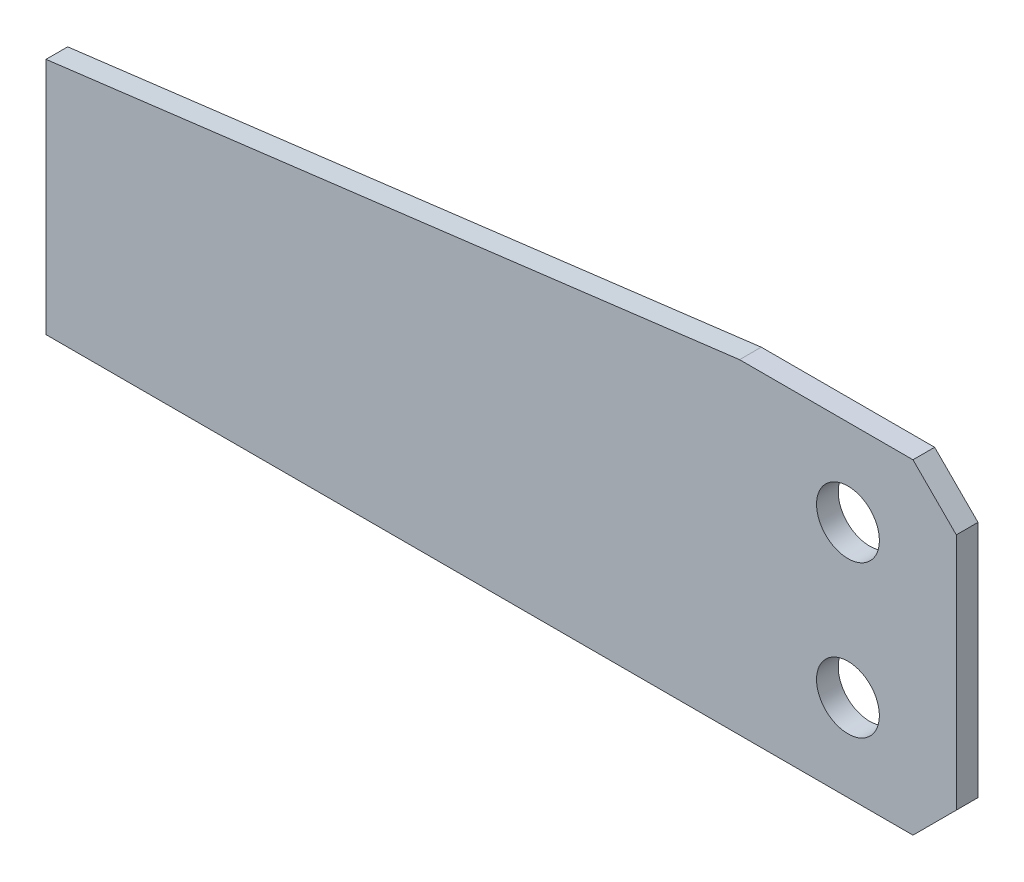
ISO-10303-21;
HEADER;
FILE_DESCRIPTION(('STEP AP214'),'2;1');
FILE_NAME('part.step','',(''),(''),'','','');
FILE_SCHEMA(('AUTOMOTIVE_DESIGN { 1 0 10303 214 1 1 1 1 }'));
ENDSEC;
DATA;
#1=APPLICATION_CONTEXT('core data for automotive mechanical design processes');
#2=APPLICATION_PROTOCOL_DEFINITION('international standard','automotive_design',2000,#1);
#3=PRODUCT_CONTEXT('',#1,'mechanical');
#4=PRODUCT('Part','Part','',(#3));
#5=PRODUCT_RELATED_PRODUCT_CATEGORY('part','',(#4));
#6=PRODUCT_DEFINITION_FORMATION('','',#4);
#7=PRODUCT_DEFINITION_CONTEXT('part definition',#1,'design');
#8=PRODUCT_DEFINITION('design','',#6,#7);
#9=PRODUCT_DEFINITION_SHAPE('','',#8);
#10=(LENGTH_UNIT() NAMED_UNIT(*) SI_UNIT(.MILLI.,.METRE.));
#11=(NAMED_UNIT(*) PLANE_ANGLE_UNIT() SI_UNIT($,.RADIAN.));
#12=(NAMED_UNIT(*) SI_UNIT($,.STERADIAN.) SOLID_ANGLE_UNIT());
#13=UNCERTAINTY_MEASURE_WITH_UNIT(LENGTH_MEASURE(1.E-05),#10,'distance_accuracy_value','');
#14=(GEOMETRIC_REPRESENTATION_CONTEXT(3) GLOBAL_UNCERTAINTY_ASSIGNED_CONTEXT((#13)) GLOBAL_UNIT_ASSIGNED_CONTEXT((#10,
#11,#12)) REPRESENTATION_CONTEXT('',''));
#15=CARTESIAN_POINT('',(0.,0.,0.));
#16=DIRECTION('',(0.,0.,1.));
#17=DIRECTION('',(1.,0.,0.));
#18=AXIS2_PLACEMENT_3D('',#15,#16,#17);
#19=CARTESIAN_POINT('',(-420.,-150.,10.));
#20=DIRECTION('',(0.,0.,-1.));
#21=DIRECTION('',(-1.,0.,0.));
#22=AXIS2_PLACEMENT_3D('',#19,#20,#21);
#23=PLANE('',#22);
#24=CARTESIAN_POINT('',(-50.,-40.,10.));
#25=DIRECTION('',(0.,0.,1.));
#26=DIRECTION('',(1.,0.,0.));
#27=AXIS2_PLACEMENT_3D('',#24,#25,#26);
#28=CIRCLE('',#27,14.5);
#29=CARTESIAN_POINT('',(-35.5,-40.,10.));
#30=VERTEX_POINT('',#29);
#31=EDGE_CURVE('E107',#30,#30,#28,.T.);
#32=ORIENTED_EDGE('',*,*,#31,.F.);
#33=EDGE_LOOP('',(#32));
#34=FACE_BOUND('',#33,.T.);
#35=DIRECTION('',(0.,-1.,0.));
#36=VECTOR('',#35,1.);
#37=CARTESIAN_POINT('',(-420.,-40.,10.));
#38=LINE('',#37,#36);
#39=CARTESIAN_POINT('',(-420.,-40.,10.));
#40=VERTEX_POINT('',#39);
#41=CARTESIAN_POINT('',(-420.,-150.,10.));
#42=VERTEX_POINT('',#41);
#43=EDGE_CURVE('E123',#40,#42,#38,.T.);
#44=ORIENTED_EDGE('',*,*,#43,.T.);
#45=DIRECTION('',(1.,0.,0.));
#46=VECTOR('',#45,1.);
#47=CARTESIAN_POINT('',(-20.,-150.,10.));
#48=LINE('',#47,#46);
#49=CARTESIAN_POINT('',(-20.,-150.,10.));
#50=VERTEX_POINT('',#49);
#51=EDGE_CURVE('E102',#42,#50,#48,.T.);
#52=ORIENTED_EDGE('',*,*,#51,.T.);
#53=DIRECTION('',(0.707106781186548,0.707106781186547,0.));
#54=VECTOR('',#53,1.);
#55=CARTESIAN_POINT('',(0.,-130.,10.));
#56=LINE('',#55,#54);
#57=CARTESIAN_POINT('',(0.,-130.,10.));
#58=VERTEX_POINT('',#57);
#59=EDGE_CURVE('E126',#50,#58,#56,.T.);
#60=ORIENTED_EDGE('',*,*,#59,.T.);
#61=DIRECTION('',(0.,1.,0.));
#62=VECTOR('',#61,1.);
#63=CARTESIAN_POINT('',(0.,-19.9999999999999,10.));
#64=LINE('',#63,#62);
#65=CARTESIAN_POINT('',(0.,-19.9999999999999,10.));
#66=VERTEX_POINT('',#65);
#67=EDGE_CURVE('E128',#58,#66,#64,.T.);
#68=ORIENTED_EDGE('',*,*,#67,.T.);
#69=DIRECTION('',(-0.707106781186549,0.707106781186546,0.));
#70=VECTOR('',#69,1.);
#71=CARTESIAN_POINT('',(0.,-19.9999999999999,10.));
#72=LINE('',#71,#70);
#73=CARTESIAN_POINT('',(-20.,0.,10.));
#74=VERTEX_POINT('',#73);
#75=EDGE_CURVE('E130',#66,#74,#72,.T.);
#76=ORIENTED_EDGE('',*,*,#75,.T.);
#77=DIRECTION('',(-1.,0.,0.));
#78=VECTOR('',#77,1.);
#79=CARTESIAN_POINT('',(-20.,0.,10.));
#80=LINE('',#79,#78);
#81=CARTESIAN_POINT('',(-100.,0.,10.));
#82=VERTEX_POINT('',#81);
#83=EDGE_CURVE('E49',#74,#82,#80,.T.);
#84=ORIENTED_EDGE('',*,*,#83,.T.);
#85=DIRECTION('',(-0.992277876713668,-0.124034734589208,0.));
#86=VECTOR('',#85,1.);
#87=CARTESIAN_POINT('',(-100.,0.,10.));
#88=LINE('',#87,#86);
#89=EDGE_CURVE('E44',#82,#40,#88,.T.);
#90=ORIENTED_EDGE('',*,*,#89,.T.);
#91=EDGE_LOOP('',(#44,#52,#60,#68,#76,#84,#90));
#92=FACE_BOUND('',#91,.T.);
#93=CARTESIAN_POINT('',(-50.,-110.,10.));
#94=DIRECTION('',(0.,0.,1.));
#95=DIRECTION('',(1.,0.,0.));
#96=AXIS2_PLACEMENT_3D('',#93,#94,#95);
#97=CIRCLE('',#96,14.5);
#98=CARTESIAN_POINT('',(-35.5,-110.,10.));
#99=VERTEX_POINT('',#98);
#100=EDGE_CURVE('E193',#99,#99,#97,.T.);
#101=ORIENTED_EDGE('',*,*,#100,.F.);
#102=EDGE_LOOP('',(#101));
#103=FACE_BOUND('',#102,.T.);
#104=ADVANCED_FACE('F29',(#34,#92,#103),#23,.F.);
#105=CARTESIAN_POINT('',(-420.,-150.,0.));
#106=DIRECTION('',(0.,0.,-1.));
#107=DIRECTION('',(-1.,0.,0.));
#108=AXIS2_PLACEMENT_3D('',#105,#106,#107);
#109=PLANE('',#108);
#110=CARTESIAN_POINT('',(-50.,-40.,0.));
#111=DIRECTION('',(0.,0.,1.));
#112=DIRECTION('',(1.,0.,0.));
#113=AXIS2_PLACEMENT_3D('',#110,#111,#112);
#114=CIRCLE('',#113,14.5);
#115=CARTESIAN_POINT('',(-35.5,-40.,0.));
#116=VERTEX_POINT('',#115);
#117=EDGE_CURVE('E110',#116,#116,#114,.T.);
#118=ORIENTED_EDGE('',*,*,#117,.T.);
#119=EDGE_LOOP('',(#118));
#120=FACE_BOUND('',#119,.T.);
#121=DIRECTION('',(0.,-1.,0.));
#122=VECTOR('',#121,1.);
#123=CARTESIAN_POINT('',(-420.,-40.,0.));
#124=LINE('',#123,#122);
#125=CARTESIAN_POINT('',(-420.,-40.,0.));
#126=VERTEX_POINT('',#125);
#127=CARTESIAN_POINT('',(-420.,-150.,0.));
#128=VERTEX_POINT('',#127);
#129=EDGE_CURVE('E93',#126,#128,#124,.T.);
#130=ORIENTED_EDGE('',*,*,#129,.F.);
#131=DIRECTION('',(-0.992277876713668,-0.124034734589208,0.));
#132=VECTOR('',#131,1.);
#133=CARTESIAN_POINT('',(-100.,0.,0.));
#134=LINE('',#133,#132);
#135=CARTESIAN_POINT('',(-100.,0.,0.));
#136=VERTEX_POINT('',#135);
#137=EDGE_CURVE('E121',#136,#126,#134,.T.);
#138=ORIENTED_EDGE('',*,*,#137,.F.);
#139=DIRECTION('',(-1.,0.,0.));
#140=VECTOR('',#139,1.);
#141=CARTESIAN_POINT('',(-20.,0.,0.));
#142=LINE('',#141,#140);
#143=CARTESIAN_POINT('',(-20.,0.,0.));
#144=VERTEX_POINT('',#143);
#145=EDGE_CURVE('E119',#144,#136,#142,.T.);
#146=ORIENTED_EDGE('',*,*,#145,.F.);
#147=DIRECTION('',(-0.707106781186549,0.707106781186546,0.));
#148=VECTOR('',#147,1.);
#149=CARTESIAN_POINT('',(0.,-19.9999999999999,0.));
#150=LINE('',#149,#148);
#151=CARTESIAN_POINT('',(0.,-19.9999999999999,0.));
#152=VERTEX_POINT('',#151);
#153=EDGE_CURVE('E117',#152,#144,#150,.T.);
#154=ORIENTED_EDGE('',*,*,#153,.F.);
#155=DIRECTION('',(0.,1.,0.));
#156=VECTOR('',#155,1.);
#157=CARTESIAN_POINT('',(0.,-19.9999999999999,0.));
#158=LINE('',#157,#156);
#159=CARTESIAN_POINT('',(0.,-130.,0.));
#160=VERTEX_POINT('',#159);
#161=EDGE_CURVE('E115',#160,#152,#158,.T.);
#162=ORIENTED_EDGE('',*,*,#161,.F.);
#163=DIRECTION('',(0.707106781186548,0.707106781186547,0.));
#164=VECTOR('',#163,1.);
#165=CARTESIAN_POINT('',(0.,-130.,0.));
#166=LINE('',#165,#164);
#167=CARTESIAN_POINT('',(-20.,-150.,0.));
#168=VERTEX_POINT('',#167);
#169=EDGE_CURVE('E95',#168,#160,#166,.T.);
#170=ORIENTED_EDGE('',*,*,#169,.F.);
#171=DIRECTION('',(1.,0.,0.));
#172=VECTOR('',#171,1.);
#173=CARTESIAN_POINT('',(-20.,-150.,0.));
#174=LINE('',#173,#172);
#175=EDGE_CURVE('E88',#128,#168,#174,.T.);
#176=ORIENTED_EDGE('',*,*,#175,.F.);
#177=EDGE_LOOP('',(#130,#138,#146,#154,#162,#170,#176));
#178=FACE_BOUND('',#177,.T.);
#179=CARTESIAN_POINT('',(-50.,-110.,0.));
#180=DIRECTION('',(0.,0.,1.));
#181=DIRECTION('',(1.,0.,0.));
#182=AXIS2_PLACEMENT_3D('',#179,#180,#181);
#183=CIRCLE('',#182,14.5);
#184=CARTESIAN_POINT('',(-35.5,-110.,0.));
#185=VERTEX_POINT('',#184);
#186=EDGE_CURVE('E196',#185,#185,#183,.T.);
#187=ORIENTED_EDGE('',*,*,#186,.T.);
#188=EDGE_LOOP('',(#187));
#189=FACE_BOUND('',#188,.T.);
#190=ADVANCED_FACE('F89',(#120,#178,#189),#109,.T.);
#191=CARTESIAN_POINT('',(-420.,-40.,10.));
#192=DIRECTION('',(1.,0.,0.));
#193=DIRECTION('',(0.,1.,0.));
#194=AXIS2_PLACEMENT_3D('',#191,#192,#193);
#195=PLANE('',#194);
#196=ORIENTED_EDGE('',*,*,#129,.T.);
#197=DIRECTION('',(0.,0.,-1.));
#198=VECTOR('',#197,1.);
#199=CARTESIAN_POINT('',(-420.,-150.,10.));
#200=LINE('',#199,#198);
#201=EDGE_CURVE('E11',#42,#128,#200,.T.);
#202=ORIENTED_EDGE('',*,*,#201,.F.);
#203=ORIENTED_EDGE('',*,*,#43,.F.);
#204=DIRECTION('',(0.,0.,-1.));
#205=VECTOR('',#204,1.);
#206=CARTESIAN_POINT('',(-420.,-40.,10.));
#207=LINE('',#206,#205);
#208=EDGE_CURVE('E106',#40,#126,#207,.T.);
#209=ORIENTED_EDGE('',*,*,#208,.T.);
#210=EDGE_LOOP('',(#196,#202,#203,#209));
#211=FACE_BOUND('',#210,.T.);
#212=ADVANCED_FACE('F31',(#211),#195,.F.);
#213=CARTESIAN_POINT('',(-20.,-150.,10.));
#214=DIRECTION('',(0.,1.,0.));
#215=DIRECTION('',(-1.,0.,0.));
#216=AXIS2_PLACEMENT_3D('',#213,#214,#215);
#217=PLANE('',#216);
#218=ORIENTED_EDGE('',*,*,#175,.T.);
#219=DIRECTION('',(0.,0.,-1.));
#220=VECTOR('',#219,1.);
#221=CARTESIAN_POINT('',(-20.,-150.,10.));
#222=LINE('',#221,#220);
#223=EDGE_CURVE('E37',#50,#168,#222,.T.);
#224=ORIENTED_EDGE('',*,*,#223,.F.);
#225=ORIENTED_EDGE('',*,*,#51,.F.);
#226=ORIENTED_EDGE('',*,*,#201,.T.);
#227=EDGE_LOOP('',(#218,#224,#225,#226));
#228=FACE_BOUND('',#227,.T.);
#229=ADVANCED_FACE('F101',(#228),#217,.F.);
#230=CARTESIAN_POINT('',(0.,-130.,10.));
#231=DIRECTION('',(-0.707106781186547,0.707106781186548,0.));
#232=DIRECTION('',(-0.707106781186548,-0.707106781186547,0.));
#233=AXIS2_PLACEMENT_3D('',#230,#231,#232);
#234=PLANE('',#233);
#235=ORIENTED_EDGE('',*,*,#169,.T.);
#236=DIRECTION('',(0.,0.,-1.));
#237=VECTOR('',#236,1.);
#238=CARTESIAN_POINT('',(0.,-130.,10.));
#239=LINE('',#238,#237);
#240=EDGE_CURVE('E144',#58,#160,#239,.T.);
#241=ORIENTED_EDGE('',*,*,#240,.F.);
#242=ORIENTED_EDGE('',*,*,#59,.F.);
#243=ORIENTED_EDGE('',*,*,#223,.T.);
#244=EDGE_LOOP('',(#235,#241,#242,#243));
#245=FACE_BOUND('',#244,.T.);
#246=ADVANCED_FACE('F148',(#245),#234,.F.);
#247=CARTESIAN_POINT('',(0.,-19.9999999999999,10.));
#248=DIRECTION('',(-1.,0.,0.));
#249=DIRECTION('',(0.,-1.,0.));
#250=AXIS2_PLACEMENT_3D('',#247,#248,#249);
#251=PLANE('',#250);
#252=ORIENTED_EDGE('',*,*,#161,.T.);
#253=DIRECTION('',(0.,0.,-1.));
#254=VECTOR('',#253,1.);
#255=CARTESIAN_POINT('',(0.,-19.9999999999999,10.));
#256=LINE('',#255,#254);
#257=EDGE_CURVE('E141',#66,#152,#256,.T.);
#258=ORIENTED_EDGE('',*,*,#257,.F.);
#259=ORIENTED_EDGE('',*,*,#67,.F.);
#260=ORIENTED_EDGE('',*,*,#240,.T.);
#261=EDGE_LOOP('',(#252,#258,#259,#260));
#262=FACE_BOUND('',#261,.T.);
#263=ADVANCED_FACE('F156',(#262),#251,.F.);
#264=CARTESIAN_POINT('',(0.,-19.9999999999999,10.));
#265=DIRECTION('',(-0.707106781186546,-0.707106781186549,0.));
#266=DIRECTION('',(0.707106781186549,-0.707106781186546,0.));
#267=AXIS2_PLACEMENT_3D('',#264,#265,#266);
#268=PLANE('',#267);
#269=ORIENTED_EDGE('',*,*,#153,.T.);
#270=DIRECTION('',(0.,0.,-1.));
#271=VECTOR('',#270,1.);
#272=CARTESIAN_POINT('',(-20.,0.,10.));
#273=LINE('',#272,#271);
#274=EDGE_CURVE('E138',#74,#144,#273,.T.);
#275=ORIENTED_EDGE('',*,*,#274,.F.);
#276=ORIENTED_EDGE('',*,*,#75,.F.);
#277=ORIENTED_EDGE('',*,*,#257,.T.);
#278=EDGE_LOOP('',(#269,#275,#276,#277));
#279=FACE_BOUND('',#278,.T.);
#280=ADVANCED_FACE('F159',(#279),#268,.F.);
#281=CARTESIAN_POINT('',(-20.,0.,10.));
#282=DIRECTION('',(0.,-1.,0.));
#283=DIRECTION('',(1.,0.,0.));
#284=AXIS2_PLACEMENT_3D('',#281,#282,#283);
#285=PLANE('',#284);
#286=ORIENTED_EDGE('',*,*,#145,.T.);
#287=DIRECTION('',(0.,0.,-1.));
#288=VECTOR('',#287,1.);
#289=CARTESIAN_POINT('',(-100.,0.,10.));
#290=LINE('',#289,#288);
#291=EDGE_CURVE('E135',#82,#136,#290,.T.);
#292=ORIENTED_EDGE('',*,*,#291,.F.);
#293=ORIENTED_EDGE('',*,*,#83,.F.);
#294=ORIENTED_EDGE('',*,*,#274,.T.);
#295=EDGE_LOOP('',(#286,#292,#293,#294));
#296=FACE_BOUND('',#295,.T.);
#297=ADVANCED_FACE('F162',(#296),#285,.F.);
#298=CARTESIAN_POINT('',(-100.,0.,10.));
#299=DIRECTION('',(0.124034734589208,-0.992277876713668,0.));
#300=DIRECTION('',(0.992277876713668,0.124034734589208,0.));
#301=AXIS2_PLACEMENT_3D('',#298,#299,#300);
#302=PLANE('',#301);
#303=ORIENTED_EDGE('',*,*,#137,.T.);
#304=ORIENTED_EDGE('',*,*,#208,.F.);
#305=ORIENTED_EDGE('',*,*,#89,.F.);
#306=ORIENTED_EDGE('',*,*,#291,.T.);
#307=EDGE_LOOP('',(#303,#304,#305,#306));
#308=FACE_BOUND('',#307,.T.);
#309=ADVANCED_FACE('F164',(#308),#302,.F.);
#310=CARTESIAN_POINT('',(-50.,-40.,10.));
#311=DIRECTION('',(0.,0.,-1.));
#312=DIRECTION('',(-1.,0.,0.));
#313=AXIS2_PLACEMENT_3D('',#310,#311,#312);
#314=CYLINDRICAL_SURFACE('',#313,14.5);
#315=ORIENTED_EDGE('',*,*,#31,.T.);
#316=EDGE_LOOP('',(#315));
#317=FACE_BOUND('',#316,.T.);
#318=ORIENTED_EDGE('',*,*,#117,.F.);
#319=EDGE_LOOP('',(#318));
#320=FACE_BOUND('',#319,.T.);
#321=ADVANCED_FACE('F166',(#317,#320),#314,.F.);
#322=CARTESIAN_POINT('',(-50.,-110.,10.));
#323=DIRECTION('',(0.,0.,-1.));
#324=DIRECTION('',(-1.,0.,0.));
#325=AXIS2_PLACEMENT_3D('',#322,#323,#324);
#326=CYLINDRICAL_SURFACE('',#325,14.5);
#327=ORIENTED_EDGE('',*,*,#100,.T.);
#328=EDGE_LOOP('',(#327));
#329=FACE_BOUND('',#328,.T.);
#330=ORIENTED_EDGE('',*,*,#186,.F.);
#331=EDGE_LOOP('',(#330));
#332=FACE_BOUND('',#331,.T.);
#333=ADVANCED_FACE('F172',(#329,#332),#326,.F.);
#334=CLOSED_SHELL('',(#104,#190,#212,#229,#246,#263,#280,#297,#309,#321,#333));
#335=MANIFOLD_SOLID_BREP('B2',#334);
#336=ADVANCED_BREP_SHAPE_REPRESENTATION('',(#18,#335),#14);
#337=SHAPE_DEFINITION_REPRESENTATION(#9,#336);
ENDSEC;
END-ISO-10303-21;
